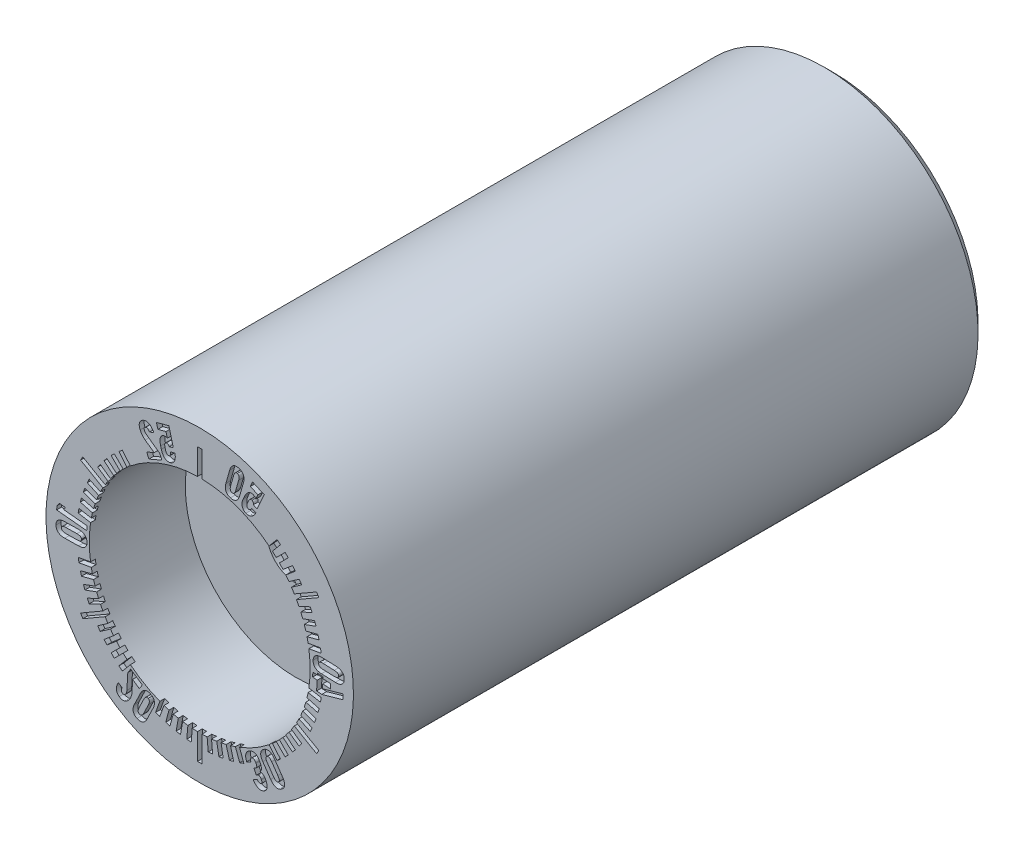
from build123d import *

# Parameters (mm, degrees)
SKETCH2_W          = 0.23
SKETCH2_H          = 1.36
CUT_EXTRUDE1_DEPTH = 0.25


with BuildPart() as part:
    # Sketch1 → Revolve1 (revolve)
    with BuildSketch(Plane(origin=(0, 0, 0), x_dir=(0, 0, -1), z_dir=(1, 0, 0))):
        Polygon((33, 4), (33, 7.5), (32.5, 8), (0, 8), (0, 5.75), (5, 5.75), (5, 1.5), (24, 1.5), (24, 4), align=None)
    revolve(axis=Axis((0, 0, 0), (0, 0, 1)))

    # Sketch2 → Cut-Extrude1 (cut)
    # profile 1 of 58: a face of its own
    with BuildSketch(Plane.XY):
        Polygon((-0.613964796, -5.69817271), (-0.384840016, -5.71821853), (-0.443234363, -6.385668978), (-0.672359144, -6.365623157), align=None)
    # profile 2 of 58: a face of its own
    with BuildSketch(Plane.XY):
        with Locations((0, 6.41)):
            Rectangle(SKETCH2_W, SKETCH2_H)
    # profile 3 of 58: a face of its own
    with BuildSketch(Plane.XY):
        Polygon((6.082620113, 3.644592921), (6.197620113, 3.445407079), (5.019825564, 2.765407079), (4.904825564, 2.964592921), align=None)
    # profile 4 of 58: a face of its own
    with BuildSketch(Plane.XY):
        Polygon((-1.10825695, -5.622978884), (-0.881751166, -5.662917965), (-0.998095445, -6.32273916), (-1.224601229, -6.282800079), align=None)
    # profile 5 of 58: a face of its own
    with BuildSketch(Plane.XY):
        Polygon((-1.594114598, -5.504990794), (-1.371951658, -5.564519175), (-1.545360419, -6.211689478), (-1.767523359, -6.152161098), align=None)
    # profile 6 of 58: a face of its own
    with BuildSketch(Plane.XY):
        Polygon((-2.067840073, -5.345106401), (-1.85171077, -5.423771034), (-2.080864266, -6.05336509), (-2.296993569, -5.974700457), align=None)
    # profile 7 of 58: a face of its own
    with BuildSketch(Plane.XY):
        with BuildLine():
            Line((2.445608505, -5.829393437), (2.661987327, -5.721853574))
            add(Edge.make_bspline(
                [(2.661987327, -5.721853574), (2.651809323, -5.6949133), (2.642890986, -5.654093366), (2.648126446, -5.601821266), (2.665063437, -5.559111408), (2.690776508, -5.53560956), (2.710836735, -5.526187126)],
                knots=[0, 0, 0, 0, 0.389245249, 0.552170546, 0.70216859, 1, 1, 1, 1], degree=3))
            add(Edge.make_bspline(
                [(2.710836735, -5.526187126), (2.728864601, -5.517712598), (2.758018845, -5.507920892), (2.797464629, -5.512052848), (2.825233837, -5.522007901), (2.851226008, -5.53879053), (2.885288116, -5.57128034), (2.904186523, -5.603274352), (2.91604825, -5.625892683)],
                knots=[0, 0, 0, 0, 0.23438613, 0.344211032, 0.455536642, 0.574540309, 0.701359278, 1, 1, 1, 1], degree=3))
            Line((2.91604825, -5.625892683), (2.932568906, -5.659008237))
            add(Edge.make_bspline(
                [(2.932568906, -5.659008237), (2.944143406, -5.683119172), (2.9597508, -5.71840926), (2.968323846, -5.765914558), (2.969560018, -5.796281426), (2.96456007, -5.823382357), (2.950229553, -5.854787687), (2.929749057, -5.871299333), (2.914837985, -5.878651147)],
                knots=[0, 0, 0, 0, 0.327056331, 0.463872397, 0.585664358, 0.694908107, 0.796361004, 1, 1, 1, 1], degree=3))
            Line((2.914837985, -5.878651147), (2.820849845, -5.925405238))
            Line((2.820849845, -5.925405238), (2.948993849, -6.182840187))
            Line((2.948993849, -6.182840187), (3.042981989, -6.136086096))
            add(Edge.make_bspline(
                [(3.042981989, -6.136086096), (3.055299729, -6.129691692), (3.076557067, -6.125570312), (3.104602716, -6.132367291), (3.124969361, -6.143937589), (3.145103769, -6.160485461), (3.17191165, -6.192052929), (3.189159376, -6.21995374), (3.19922707, -6.240709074)],
                knots=[0, 0, 0, 0, 0.198237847, 0.297495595, 0.408102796, 0.531347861, 0.669627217, 1, 1, 1, 1], degree=3))
            Line((3.19922707, -6.240709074), (3.211345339, -6.265238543))
            add(Edge.make_bspline(
                [(3.211345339, -6.265238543), (3.220742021, -6.284735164), (3.233033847, -6.313560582), (3.238904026, -6.352540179), (3.238458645, -6.377758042), (3.23317576, -6.400459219), (3.218801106, -6.426816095), (3.201090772, -6.441259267), (3.187546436, -6.447565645)],
                knots=[0, 0, 0, 0, 0.315551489, 0.448835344, 0.569436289, 0.679683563, 0.783667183, 1, 1, 1, 1], degree=3))
            add(Edge.make_bspline(
                [(3.187546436, -6.447565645), (3.17830772, -6.452309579), (3.163230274, -6.456400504), (3.142312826, -6.457289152), (3.126332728, -6.45457774), (3.109835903, -6.449990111), (3.093309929, -6.442496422), (3.07663056, -6.432701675), (3.060004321, -6.420364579), (3.043244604, -6.405708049), (3.020771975, -6.381735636), (3.00535098, -6.361508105), (2.995346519, -6.347214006)],
                knots=[0, 0, 0, 0, 0.131371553, 0.196429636, 0.264882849, 0.336661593, 0.413849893, 0.494996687, 0.582417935, 0.676904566, 0.777945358, 1, 1, 1, 1], degree=3))
            Line((2.995346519, -6.347214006), (2.779869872, -6.454629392))
            add(Edge.make_bspline(
                [(2.779869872, -6.454629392), (2.802870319, -6.493849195), (2.8409568, -6.548523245), (2.899315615, -6.612286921), (2.944542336, -6.651349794), (2.99103997, -6.683516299), (3.038500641, -6.708766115), (3.086877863, -6.726424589), (3.135747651, -6.736668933), (3.184406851, -6.739465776), (3.24892362, -6.733404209), (3.295367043, -6.717776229), (3.324393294, -6.703110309)],
                knots=[0, 0, 0, 0, 0.205722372, 0.300436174, 0.390487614, 0.475581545, 0.555836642, 0.633118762, 0.707861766, 0.781015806, 0.852868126, 1, 1, 1, 1], degree=3))
            add(Edge.make_bspline(
                [(3.324393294, -6.703110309), (3.347486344, -6.691305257), (3.380364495, -6.671723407), (3.418900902, -6.640099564), (3.443478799, -6.614796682), (3.464204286, -6.587259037), (3.48172627, -6.558029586), (3.495133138, -6.526513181), (3.505301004, -6.493407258), (3.511847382, -6.458686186), (3.514107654, -6.422550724), (3.51289223, -6.385157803), (3.507606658, -6.346493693), (3.498866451, -6.306570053), (3.481453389, -6.250209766), (3.463255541, -6.208519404), (3.449509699, -6.180664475)],
                knots=[0, 0, 0, 0, 0.127639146, 0.187303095, 0.244722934, 0.300675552, 0.356461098, 0.411895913, 0.468674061, 0.526509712, 0.585217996, 0.6463877, 0.710214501, 0.77685814, 0.847179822, 1, 1, 1, 1], degree=3))
            Line((3.449509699, -6.180664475), (3.428205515, -6.137866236))
            add(Edge.make_bspline(
                [(3.428205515, -6.137866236), (3.412790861, -6.107011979), (3.386075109, -6.063624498), (3.341111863, -6.014870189), (3.305001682, -5.985053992), (3.266318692, -5.96105214), (3.211499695, -5.93885842), (3.167883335, -5.931189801), (3.138627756, -5.931434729)],
                knots=[0, 0, 0, 0, 0.276131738, 0.404287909, 0.528874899, 0.64966238, 0.766898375, 1, 1, 1, 1], degree=3))
            add(Edge.make_bspline(
                [(3.138627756, -5.931434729), (3.161028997, -5.910964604), (3.187779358, -5.872339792), (3.206128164, -5.811908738), (3.210967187, -5.761217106), (3.207609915, -5.706648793), (3.190666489, -5.626172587), (3.167067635, -5.566451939), (3.146940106, -5.526922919)],
                knots=[0, 0, 0, 0, 0.208985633, 0.317146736, 0.433273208, 0.559005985, 0.693520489, 1, 1, 1, 1], degree=3))
            Line((3.146940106, -5.526922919), (3.125635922, -5.484124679))
            add(Edge.make_bspline(
                [(3.125635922, -5.484124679), (3.107031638, -5.445301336), (3.074164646, -5.392013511), (3.023461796, -5.329063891), (2.983440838, -5.291211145), (2.941720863, -5.25975852), (2.897393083, -5.236670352), (2.851702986, -5.219935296), (2.803995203, -5.211940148), (2.754990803, -5.210977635), (2.686497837, -5.220644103), (2.636805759, -5.239695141), (2.604523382, -5.255397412)],
                knots=[0, 0, 0, 0, 0.199662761, 0.289879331, 0.374672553, 0.454952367, 0.531756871, 0.606027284, 0.680061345, 0.75535563, 0.832918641, 1, 1, 1, 1], degree=3))
            add(Edge.make_bspline(
                [(2.604523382, -5.255397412), (2.572554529, -5.271444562), (2.527795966, -5.300551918), (2.478016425, -5.349917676), (2.447455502, -5.390972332), (2.422758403, -5.435810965), (2.404692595, -5.484260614), (2.393934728, -5.536245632), (2.389593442, -5.591110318), (2.392309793, -5.6485589), (2.406232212, -5.729967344), (2.428100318, -5.78979257), (2.445608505, -5.829393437)],
                knots=[0, 0, 0, 0, 0.161105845, 0.238201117, 0.314561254, 0.390768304, 0.467980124, 0.546459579, 0.6290429, 0.715177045, 0.804752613, 1, 1, 1, 1], degree=3))
        make_face()
    # profile 8 of 58: a face of its own
    with BuildSketch(Plane.XY):
        with BuildLine():
            Line((3.283704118, -5.405476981), (3.692754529, -5.997874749))
            add(Edge.make_bspline(
                [(3.692754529, -5.997874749), (3.71181555, -6.025645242), (3.741998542, -6.064578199), (3.786128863, -6.110800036), (3.819163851, -6.140308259), (3.853221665, -6.165517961), (3.887729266, -6.18714618), (3.923436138, -6.203894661), (3.959444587, -6.216969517), (3.996054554, -6.225702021), (4.032952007, -6.229534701), (4.06992987, -6.22894415), (4.107017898, -6.223758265), (4.144250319, -6.213916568), (4.195196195, -6.19373006), (4.231520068, -6.172420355), (4.255171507, -6.156354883)],
                knots=[0, 0, 0, 0, 0.152206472, 0.222057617, 0.288528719, 0.352081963, 0.413336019, 0.47221913, 0.529940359, 0.586185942, 0.641826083, 0.69712275, 0.752898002, 0.810629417, 0.87072242, 1, 1, 1, 1], degree=3))
            add(Edge.make_bspline(
                [(4.255171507, -6.156354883), (4.278586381, -6.139782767), (4.311806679, -6.113550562), (4.348494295, -6.072758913), (4.370819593, -6.041319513), (4.389092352, -6.008636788), (4.403217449, -5.974299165), (4.412472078, -5.938382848), (4.417538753, -5.901121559), (4.41801071, -5.862881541), (4.414851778, -5.82371284), (4.406790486, -5.78395945), (4.395282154, -5.743147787), (4.379063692, -5.701809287), (4.351517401, -5.643852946), (4.325136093, -5.60203146), (4.306210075, -5.574055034)],
                knots=[0, 0, 0, 0, 0.129652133, 0.189922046, 0.247023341, 0.303334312, 0.358574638, 0.414100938, 0.470267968, 0.52787655, 0.586376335, 0.647273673, 0.71063341, 0.777531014, 0.847418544, 1, 1, 1, 1], degree=3))
            Line((4.306210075, -5.574055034), (3.897159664, -4.981657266))
            add(Edge.make_bspline(
                [(3.897159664, -4.981657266), (3.878111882, -4.953871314), (3.847891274, -4.914982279), (3.803748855, -4.868621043), (3.770560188, -4.839295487), (3.736632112, -4.813924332), (3.702178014, -4.792393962), (3.666479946, -4.775637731), (3.630468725, -4.762553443), (3.593861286, -4.753864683), (3.556916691, -4.749864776), (3.519830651, -4.751073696), (3.48263391, -4.755773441), (3.445488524, -4.766038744), (3.394589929, -4.786037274), (3.35828827, -4.807448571), (3.334629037, -4.823478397)],
                knots=[0, 0, 0, 0, 0.152176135, 0.222013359, 0.288924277, 0.351998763, 0.413240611, 0.472111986, 0.52982171, 0.586056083, 0.641685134, 0.697151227, 0.753341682, 0.810667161, 0.870748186, 1, 1, 1, 1], degree=3))
            add(Edge.make_bspline(
                [(3.334629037, -4.823478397), (3.310798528, -4.839555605), (3.278089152, -4.866379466), (3.241221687, -4.907132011), (3.21887631, -4.938687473), (3.200895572, -4.971634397), (3.18706237, -5.006080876), (3.178096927, -5.042217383), (3.173322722, -5.079644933), (3.172697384, -5.11815497), (3.176154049, -5.157446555), (3.184154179, -5.197348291), (3.195656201, -5.238007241), (3.211694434, -5.279090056), (3.23905706, -5.336368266), (3.264760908, -5.37795411), (3.283704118, -5.405476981)],
                knots=[0, 0, 0, 0, 0.129871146, 0.190225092, 0.247875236, 0.30419583, 0.359502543, 0.415159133, 0.47198713, 0.529676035, 0.588904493, 0.649886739, 0.713334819, 0.779640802, 0.848939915, 1, 1, 1, 1], degree=3))
        make_face()
        with BuildLine():
            Line((3.747047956, -5.177970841), (4.069477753, -5.645118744))
            add(Edge.make_bspline(
                [(4.069477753, -5.645118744), (4.088955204, -5.673009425), (4.113808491, -5.714479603), (4.135726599, -5.77101696), (4.143867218, -5.807754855), (4.14390305, -5.841700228), (4.132578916, -5.88351946), (4.109357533, -5.907613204), (4.091890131, -5.919592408)],
                knots=[0, 0, 0, 0, 0.330237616, 0.465954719, 0.586663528, 0.693024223, 0.792259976, 1, 1, 1, 1], degree=3))
            add(Edge.make_bspline(
                [(4.091890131, -5.919592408), (4.074373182, -5.931550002), (4.043716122, -5.944884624), (4.000599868, -5.940838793), (3.969049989, -5.928763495), (3.937464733, -5.908318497), (3.892187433, -5.867870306), (3.862171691, -5.82981349), (3.842752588, -5.801862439)],
                knots=[0, 0, 0, 0, 0.208249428, 0.306743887, 0.4129016, 0.532913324, 0.669579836, 1, 1, 1, 1], degree=3))
            Line((3.842752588, -5.801862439), (3.52032279, -5.334714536))
            add(Edge.make_bspline(
                [(3.52032279, -5.334714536), (3.501088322, -5.306604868), (3.475498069, -5.265345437), (3.453871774, -5.208524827), (3.446148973, -5.171720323), (3.445876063, -5.137916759), (3.457858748, -5.09640456), (3.480606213, -5.072297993), (3.498211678, -5.060354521)],
                knots=[0, 0, 0, 0, 0.33104826, 0.467565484, 0.587735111, 0.694108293, 0.792235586, 1, 1, 1, 1], degree=3))
            add(Edge.make_bspline(
                [(3.498211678, -5.060354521), (3.515700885, -5.048500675), (3.546270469, -5.035048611), (3.589495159, -5.038710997), (3.621079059, -5.05083701), (3.652511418, -5.071302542), (3.697819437, -5.111644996), (3.727564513, -5.150026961), (3.747047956, -5.177970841)],
                knots=[0, 0, 0, 0, 0.207401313, 0.307193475, 0.413360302, 0.532362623, 0.669040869, 1, 1, 1, 1], degree=3))
        make_face(mode=Mode.SUBTRACT)
    # profile 9 of 58: a face of its own
    with BuildSketch(Plane.XY):
        Polygon((-3.771268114, -4.315514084), (-3.595077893, -4.463355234), (-4.025745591, -4.976605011), (-4.201935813, -4.828763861), align=None)
    # profile 10 of 58: a face of its own
    with BuildSketch(Plane.XY):
        Polygon((-4.133039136, -3.970404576), (-3.970404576, -4.133039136), (-4.44416612, -4.606800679), (-4.606800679, -4.44416612), align=None)
    # profile 11 of 58: a face of its own
    with BuildSketch(Plane.XY):
        Polygon((-4.463355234, -3.595077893), (-4.315514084, -3.771268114), (-4.828763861, -4.201935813), (-4.976605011, -4.025745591), align=None)
    # profile 12 of 58: a face of its own
    with BuildSketch(Plane.XY):
        Polygon((-4.759702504, -3.192390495), (-4.627779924, -3.380795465), (-5.176611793, -3.765091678), (-5.308534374, -3.576686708), align=None)
    # profile 13 of 58: a face of its own
    with BuildSketch(Plane.XY):
        Polygon((6.197620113, -3.445407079), (6.082620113, -3.644592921), (4.904825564, -2.964592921), (5.019825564, -2.765407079), align=None)
    # profile 14 of 58: a face of its own
    with BuildSketch(Plane.XY):
        Polygon((-5.24174472, -2.317377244), (-5.14454252, -2.525828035), (-5.751768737, -2.808982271), (-5.848970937, -2.60053148), align=None)
    # profile 15 of 58: a face of its own
    with BuildSketch(Plane.XY):
        Polygon((-5.423771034, -1.85171077), (-5.345106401, -2.067840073), (-5.974700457, -2.296993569), (-6.05336509, -2.080864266), align=None)
    # profile 16 of 58: a face of its own
    with BuildSketch(Plane.XY):
        Polygon((-5.564519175, -1.371951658), (-5.504990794, -1.594114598), (-6.152161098, -1.767523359), (-6.211689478, -1.545360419), align=None)
    # profile 17 of 58: a face of its own
    with BuildSketch(Plane.XY):
        Polygon((-5.662917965, -0.881751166), (-5.622978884, -1.10825695), (-6.282800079, -1.224601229), (-6.32273916, -0.998095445), align=None)
    # profile 18 of 58: a face of its own
    with BuildSketch(Plane.XY):
        Polygon((6.354142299, -0.838181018), (7.443637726, -0.529072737), (7.462165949, -0.263788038), (6.386655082, -0.563455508), (6.402319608, -0.337012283), (6.802276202, -0.364854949), (6.818478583, -0.130454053), (6.418534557, -0.102612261), (6.42527681, -0.005147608), (6.138401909, 0.014744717), (6.131637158, -0.082640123), (5.888343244, -0.065703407), (5.872140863, -0.300104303), (6.115355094, -0.317035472), (6.080476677, -0.819142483), align=None)
    # profile 19 of 58: a face of its own
    with BuildSketch(Plane.XY):
        Polygon((-5.622978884, 1.10825695), (-5.662917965, 0.881751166), (-6.32273916, 0.998095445), (-6.282800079, 1.224601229), align=None)
    # profile 20 of 58: a face of its own
    with BuildSketch(Plane.XY):
        Polygon((-5.504990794, 1.594114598), (-5.564519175, 1.371951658), (-6.211689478, 1.545360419), (-6.152161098, 1.767523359), align=None)
    # profile 21 of 58: a face of its own
    with BuildSketch(Plane.XY):
        Polygon((-5.345106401, 2.067840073), (-5.423771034, 1.85171077), (-6.05336509, 2.080864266), (-5.974700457, 2.296993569), align=None)
    # profile 22 of 58: a face of its own
    with BuildSketch(Plane.XY):
        Polygon((-5.14454252, 2.525828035), (-5.24174472, 2.317377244), (-5.848970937, 2.60053148), (-5.751768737, 2.808982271), align=None)
    # profile 23 of 58: a face of its own
    with BuildSketch(Plane.XY):
        with Locations((0, -6.41)):
            Rectangle(SKETCH2_W, SKETCH2_H)
    # profile 24 of 58: a face of its own
    with BuildSketch(Plane.XY):
        Polygon((-4.627779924, 3.380795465), (-4.759702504, 3.192390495), (-5.308534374, 3.576686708), (-5.176611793, 3.765091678), align=None)
    # profile 25 of 58: a face of its own
    with BuildSketch(Plane.XY):
        Polygon((-4.315514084, 3.771268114), (-4.463355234, 3.595077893), (-4.976605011, 4.025745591), (-4.828763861, 4.201935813), align=None)
    # profile 26 of 58: a face of its own
    with BuildSketch(Plane.XY):
        Polygon((-3.970404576, 4.133039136), (-4.133039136, 3.970404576), (-4.606800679, 4.44416612), (-4.44416612, 4.606800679), align=None)
    # profile 27 of 58: a face of its own
    with BuildSketch(Plane.XY):
        Polygon((-3.595077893, 4.463355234), (-3.771268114, 4.315514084), (-4.201935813, 4.828763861), (-4.025745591, 4.976605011), align=None)
    # profile 28 of 58: a face of its own
    with BuildSketch(Plane.XY):
        with BuildLine():
            Line((6.337183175, 0.084459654), (7.056690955, 0.057232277))
            add(Edge.make_bspline(
                [(7.056690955, 0.057232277), (7.09032117, 0.056193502), (7.139675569, 0.056642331), (7.203180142, 0.064587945), (7.246727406, 0.073100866), (7.287373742, 0.084971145), (7.325196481, 0.100176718), (7.360184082, 0.118385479), (7.392146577, 0.139701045), (7.420795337, 0.16404027), (7.446204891, 0.191087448), (7.467517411, 0.221327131), (7.485945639, 0.253952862), (7.499888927, 0.289901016), (7.514221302, 0.342728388), (7.51961562, 0.384445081), (7.520294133, 0.413051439)],
                knots=[0, 0, 0, 0, 0.152073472, 0.22227343, 0.28881624, 0.352284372, 0.413223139, 0.472650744, 0.530126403, 0.586359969, 0.642108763, 0.697247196, 0.753071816, 0.810938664, 0.870870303, 1, 1, 1, 1], degree=3))
            add(Edge.make_bspline(
                [(7.520294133, 0.413051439), (7.521659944, 0.441768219), (7.519390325, 0.483885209), (7.50967676, 0.537977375), (7.497713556, 0.574701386), (7.482721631, 0.609021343), (7.463285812, 0.640477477), (7.440512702, 0.669654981), (7.413613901, 0.695759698), (7.383388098, 0.719215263), (7.349944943, 0.739811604), (7.313511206, 0.757765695), (7.273695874, 0.772073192), (7.231162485, 0.78457555), (7.168074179, 0.796745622), (7.118822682, 0.801010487), (7.085038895, 0.802525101)],
                knots=[0, 0, 0, 0, 0.129600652, 0.189845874, 0.24755901, 0.303577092, 0.358530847, 0.414043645, 0.47027301, 0.527288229, 0.586455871, 0.647313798, 0.710308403, 0.77722874, 0.847291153, 1, 1, 1, 1], degree=3))
            Line((7.085038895, 0.802525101), (6.365531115, 0.829752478))
            add(Edge.make_bspline(
                [(6.365531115, 0.829752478), (6.331890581, 0.830762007), (6.282568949, 0.830242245), (6.219078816, 0.822563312), (6.175646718, 0.813335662), (6.134976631, 0.801717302), (6.097087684, 0.786909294), (6.062230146, 0.768710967), (6.030136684, 0.747712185), (6.001467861, 0.72325169), (5.976057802, 0.696215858), (5.954648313, 0.665916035), (5.936398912, 0.633189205), (5.922417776, 0.597274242), (5.907299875, 0.544731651), (5.903203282, 0.502756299), (5.901641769, 0.474287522)],
                knots=[0, 0, 0, 0, 0.152127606, 0.222354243, 0.288607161, 0.352547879, 0.413283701, 0.472061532, 0.529932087, 0.586187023, 0.641957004, 0.697116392, 0.753408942, 0.810830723, 0.870865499, 1, 1, 1, 1], degree=3))
            add(Edge.make_bspline(
                [(5.901641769, 0.474287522), (5.900727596, 0.445551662), (5.90175626, 0.403126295), (5.913179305, 0.349317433), (5.924719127, 0.312458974), (5.940334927, 0.278185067), (5.959680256, 0.246436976), (5.983162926, 0.217500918), (6.010370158, 0.191296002), (6.040797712, 0.167622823), (6.074634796, 0.147288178), (6.111041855, 0.129397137), (6.150555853, 0.11450041), (6.193104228, 0.102765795), (6.255220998, 0.089729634), (6.303981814, 0.086121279), (6.337183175, 0.084459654)],
                knots=[0, 0, 0, 0, 0.130182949, 0.19030412, 0.248064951, 0.304374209, 0.360053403, 0.415607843, 0.472264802, 0.530407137, 0.589414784, 0.650323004, 0.713490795, 0.779905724, 0.849588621, 1, 1, 1, 1], degree=3))
        make_face()
        with BuildLine():
            Line((6.432883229, 0.592050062), (6.999854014, 0.570667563))
            add(Edge.make_bspline(
                [(6.999854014, 0.570667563), (7.033999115, 0.569581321), (7.082113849, 0.564336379), (7.140569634, 0.548051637), (7.174797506, 0.532414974), (7.202001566, 0.512159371), (7.228107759, 0.477670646), (7.233989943, 0.445091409), (7.232932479, 0.423830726)],
                knots=[0, 0, 0, 0, 0.331429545, 0.466797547, 0.586951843, 0.694421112, 0.792381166, 1, 1, 1, 1], degree=3))
            add(Edge.make_bspline(
                [(7.232932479, 0.423830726), (7.232799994, 0.402422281), (7.22432524, 0.370414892), (7.195760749, 0.337877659), (7.166996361, 0.320062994), (7.131807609, 0.306579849), (7.072220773, 0.294527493), (7.023699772, 0.293821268), (6.989659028, 0.294900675)],
                knots=[0, 0, 0, 0, 0.20793446, 0.305765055, 0.41298862, 0.532559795, 0.66940328, 1, 1, 1, 1], degree=3))
            Line((6.989659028, 0.294900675), (6.422688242, 0.316283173))
            add(Edge.make_bspline(
                [(6.422688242, 0.316283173), (6.388645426, 0.317882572), (6.340187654, 0.321942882), (6.281763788, 0.338947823), (6.247563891, 0.354628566), (6.219944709, 0.374473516), (6.194447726, 0.409499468), (6.18750246, 0.441673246), (6.188969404, 0.463188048)],
                knots=[0, 0, 0, 0, 0.330757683, 0.467087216, 0.587021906, 0.693755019, 0.792300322, 1, 1, 1, 1], degree=3))
            add(Edge.make_bspline(
                [(6.188969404, 0.463188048), (6.189312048, 0.484542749), (6.198104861, 0.516295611), (6.226346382, 0.549074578), (6.25523324, 0.567055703), (6.290714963, 0.579889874), (6.350267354, 0.592124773), (6.398818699, 0.593409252), (6.432883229, 0.592050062)],
                knots=[0, 0, 0, 0, 0.206874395, 0.305502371, 0.412664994, 0.532619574, 0.669385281, 1, 1, 1, 1], degree=3))
        make_face(mode=Mode.SUBTRACT)
    # profile 29 of 58: a face of its own
    with BuildSketch(Plane.XY):
        Polygon((-6.082620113, -3.644592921), (-6.197620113, -3.445407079), (-5.019825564, -2.765407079), (-4.904825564, -2.964592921), align=None)
    # profile 30 of 58: a face of its own
    with BuildSketch(Plane.XY):
        Polygon((-6.197620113, 3.445407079), (-6.082620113, 3.644592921), (-4.904825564, 2.964592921), (-5.019825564, 2.765407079), align=None)
    # profile 31 of 58: a face of its own
    with BuildSketch(Plane.XY):
        Polygon((3.771268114, 4.315514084), (3.595077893, 4.463355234), (4.025745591, 4.976605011), (4.201935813, 4.828763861), align=None)
    # profile 32 of 58: a face of its own
    with BuildSketch(Plane.XY):
        Polygon((4.133039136, 3.970404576), (3.970404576, 4.133039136), (4.44416612, 4.606800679), (4.606800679, 4.44416612), align=None)
    # profile 33 of 58: a face of its own
    with BuildSketch(Plane.XY):
        Polygon((4.463355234, 3.595077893), (4.315514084, 3.771268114), (4.828763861, 4.201935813), (4.976605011, 4.025745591), align=None)
    # profile 34 of 58: a face of its own
    with BuildSketch(Plane.XY):
        Polygon((4.759702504, 3.192390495), (4.627779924, 3.380795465), (5.176611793, 3.765091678), (5.308534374, 3.576686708), align=None)
    # profile 35 of 58: a face of its own
    with BuildSketch(Plane.XY):
        Polygon((5.24174472, 2.317377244), (5.14454252, 2.525828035), (5.751768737, 2.808982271), (5.848970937, 2.60053148), align=None)
    # profile 36 of 58: a face of its own
    with BuildSketch(Plane.XY):
        Polygon((5.423771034, 1.85171077), (5.345106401, 2.067840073), (5.974700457, 2.296993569), (6.05336509, 2.080864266), align=None)
    # profile 37 of 58: a face of its own
    with BuildSketch(Plane.XY):
        Polygon((5.564519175, 1.371951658), (5.504990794, 1.594114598), (6.152161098, 1.767523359), (6.211689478, 1.545360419), align=None)
    # profile 38 of 58: a face of its own
    with BuildSketch(Plane.XY):
        Polygon((5.662917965, 0.881751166), (5.622978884, 1.10825695), (6.282800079, 1.224601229), (6.32273916, 0.998095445), align=None)
    # profile 39 of 58: a face of its own
    with BuildSketch(Plane.XY):
        Polygon((5.622978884, -1.10825695), (5.662917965, -0.881751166), (6.32273916, -0.998095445), (6.282800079, -1.224601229), align=None)
    # profile 40 of 58: a face of its own
    with BuildSketch(Plane.XY):
        Polygon((5.504990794, -1.594114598), (5.564519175, -1.371951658), (6.211689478, -1.545360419), (6.152161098, -1.767523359), align=None)
    # profile 41 of 58: a face of its own
    with BuildSketch(Plane.XY):
        Polygon((5.345106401, -2.067840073), (5.423771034, -1.85171077), (6.05336509, -2.080864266), (5.974700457, -2.296993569), align=None)
    # profile 42 of 58: a face of its own
    with BuildSketch(Plane.XY):
        Polygon((5.14454252, -2.525828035), (5.24174472, -2.317377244), (5.848970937, -2.60053148), (5.751768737, -2.808982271), align=None)
    # profile 43 of 58: a face of its own
    with BuildSketch(Plane.XY):
        Polygon((4.627779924, -3.380795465), (4.759702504, -3.192390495), (5.308534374, -3.576686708), (5.176611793, -3.765091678), align=None)
    # profile 44 of 58: a face of its own
    with BuildSketch(Plane.XY):
        Polygon((4.315514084, -3.771268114), (4.463355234, -3.595077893), (4.976605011, -4.025745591), (4.828763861, -4.201935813), align=None)
    # profile 45 of 58: a face of its own
    with BuildSketch(Plane.XY):
        Polygon((3.970404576, -4.133039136), (4.133039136, -3.970404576), (4.606800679, -4.44416612), (4.44416612, -4.606800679), align=None)
    # profile 46 of 58: a face of its own
    with BuildSketch(Plane.XY):
        Polygon((3.595077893, -4.463355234), (3.771268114, -4.315514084), (4.201935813, -4.828763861), (4.025745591, -4.976605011), align=None)
    # profile 47 of 58: a face of its own
    with BuildSketch(Plane.XY):
        Polygon((1.85171077, -5.423771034), (2.067840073, -5.345106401), (2.296993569, -5.974700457), (2.080864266, -6.05336509), align=None)
    # profile 48 of 58: a face of its own
    with BuildSketch(Plane.XY):
        Polygon((1.371951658, -5.564519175), (1.594114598, -5.504990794), (1.767523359, -6.152161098), (1.545360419, -6.211689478), align=None)
    # profile 49 of 58: a face of its own
    with BuildSketch(Plane.XY):
        Polygon((0.881751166, -5.662917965), (1.10825695, -5.622978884), (1.224601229, -6.282800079), (0.998095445, -6.32273916), align=None)
    # profile 50 of 58: a face of its own
    with BuildSketch(Plane.XY):
        Polygon((0.384840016, -5.71821853), (0.613964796, -5.69817271), (0.672359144, -6.365623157), (0.443234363, -6.385668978), align=None)
    # profile 51 of 58: a face of its own
    with BuildSketch(Plane.XY):
        with BuildLine():
            add(Edge.make_bspline(
                [(2.402952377, 5.34994367), (2.417967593, 5.343830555), (2.447563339, 5.331781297), (2.494497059, 5.322568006), (2.541834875, 5.320723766), (2.589515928, 5.326148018), (2.636947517, 5.339438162), (2.683643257, 5.35977653), (2.729131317, 5.38787146), (2.773244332, 5.422967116), (2.815681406, 5.465100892), (2.855461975, 5.514136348), (2.892624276, 5.569640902), (2.914263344, 5.609919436), (2.925400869, 5.630650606)],
                knots=[0, 0, 0, 0, 0.884436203, 1.743268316, 2.597943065, 3.465407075, 4.354790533, 5.280501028, 6.240180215, 7.268463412, 8.35531956, 9.502034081, 10.714308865, 12, 12, 12, 12], degree=3))
            Line((2.925400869, 5.630650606), (2.925909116, 5.631532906))
            Line((2.925909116, 5.631532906), (2.713723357, 5.726852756))
            Line((2.713723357, 5.726852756), (2.71321511, 5.725970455))
            add(Edge.make_bspline(
                [(2.71321511, 5.725970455), (2.706296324, 5.714158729), (2.693129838, 5.691680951), (2.67070775, 5.661820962), (2.646550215, 5.638022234), (2.62137956, 5.619945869), (2.59525443, 5.608470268), (2.568964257, 5.602843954), (2.542307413, 5.604639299), (2.525765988, 5.6107771), (2.517295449, 5.613920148)],
                knots=[0, 0, 0, 0, 1.316783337, 2.505845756, 3.581275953, 4.569062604, 5.470567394, 6.308469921, 7.133800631, 8, 8, 8, 8], degree=3))
            add(Edge.make_bspline(
                [(2.517295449, 5.613920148), (2.508712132, 5.618479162), (2.492115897, 5.627294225), (2.472297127, 5.647258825), (2.458472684, 5.671435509), (2.450800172, 5.699799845), (2.449466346, 5.73174676), (2.453408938, 5.766861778), (2.464161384, 5.804764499), (2.474665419, 5.830234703), (2.480230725, 5.843729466)],
                knots=[0, 0, 0, 0, 0.88925093, 1.719407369, 2.545568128, 3.423584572, 4.392701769, 5.468432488, 6.658710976, 8, 8, 8, 8], degree=3))
            Line((2.480230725, 5.843729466), (2.534324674, 5.964153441))
            add(Edge.make_bspline(
                [(2.534324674, 5.964153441), (2.540587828, 5.977300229), (2.552467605, 6.002236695), (2.573555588, 6.035144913), (2.595434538, 6.062304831), (2.619022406, 6.082607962), (2.643430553, 6.096538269), (2.668539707, 6.103288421), (2.694176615, 6.103056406), (2.709966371, 6.096936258), (2.718054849, 6.093801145)],
                knots=[0, 0, 0, 0, 1.391179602, 2.638751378, 3.728763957, 4.714188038, 5.598024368, 6.392034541, 7.176301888, 8, 8, 8, 8], degree=3))
            add(Edge.make_bspline(
                [(2.718054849, 6.093801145), (2.725297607, 6.090163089), (2.739453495, 6.083052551), (2.757463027, 6.067812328), (2.772647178, 6.05013235), (2.783588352, 6.029095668), (2.791129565, 6.005986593), (2.794940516, 5.980965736), (2.79466106, 5.954124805), (2.791633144, 5.935947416), (2.790055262, 5.926474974)],
                knots=[0, 0, 0, 0, 0.978692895, 1.91284404, 2.836347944, 3.785578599, 4.763839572, 5.770041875, 6.837943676, 8, 8, 8, 8], degree=3))
            Line((2.790055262, 5.926474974), (2.988471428, 5.837441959))
            Line((2.988471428, 5.837441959), (3.358728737, 6.661747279))
            Line((3.358728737, 6.661747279), (2.753480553, 6.933314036))
            Line((2.753480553, 6.933314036), (2.636384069, 6.672921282))
            Line((2.636384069, 6.672921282), (3.029446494, 6.496674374))
            Line((3.029446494, 6.496674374), (2.915720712, 6.243152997))
            add(Edge.make_bspline(
                [(2.915720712, 6.243152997), (2.913649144, 6.249830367), (2.90943633, 6.263409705), (2.899213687, 6.282614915), (2.886968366, 6.301714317), (2.871219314, 6.319234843), (2.854383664, 6.33613721), (2.836083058, 6.350930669), (2.816715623, 6.363405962), (2.803159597, 6.37019487), (2.796382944, 6.373588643)],
                knots=[0, 0, 0, 0, 0.919939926, 1.8708225, 2.857576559, 3.904988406, 4.968813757, 6.001880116, 7.001140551, 8, 8, 8, 8], degree=3))
            add(Edge.make_bspline(
                [(2.796382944, 6.373588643), (2.781953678, 6.379366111), (2.753865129, 6.390612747), (2.709718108, 6.398711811), (2.665994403, 6.398783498), (2.622675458, 6.390817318), (2.580252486, 6.375060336), (2.538842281, 6.351480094), (2.49842646, 6.320667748), (2.459746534, 6.281775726), (2.422272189, 6.236207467), (2.386250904, 6.183880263), (2.352726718, 6.12429674), (2.332594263, 6.081630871), (2.322138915, 6.05947329)],
                knots=[0, 0, 0, 0, 0.875578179, 1.704433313, 2.515407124, 3.330983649, 4.176952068, 5.05744134, 6.011313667, 7.036558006, 8.146089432, 9.337674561, 10.61737983, 12, 12, 12, 12], degree=3))
            Line((2.322138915, 6.05947329), (2.268044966, 5.939049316))
            add(Edge.make_bspline(
                [(2.268044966, 5.939049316), (2.258407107, 5.916481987), (2.239822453, 5.872965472), (2.219164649, 5.807380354), (2.205727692, 5.744704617), (2.199127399, 5.685044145), (2.200017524, 5.628713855), (2.207974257, 5.575898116), (2.223209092, 5.526836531), (2.245336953, 5.48171299), (2.274486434, 5.440918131), (2.310932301, 5.405307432), (2.353758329, 5.37392082), (2.386222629, 5.35809774), (2.402952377, 5.34994367)],
                knots=[0, 0, 0, 0, 1.292650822, 2.49261485, 3.617137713, 4.666146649, 5.649005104, 6.577839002, 7.471491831, 8.345616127, 9.215760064, 10.099964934, 11.020859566, 12, 12, 12, 12], degree=3))
        make_face()
    # profile 52 of 58: a face of its own
    with BuildSketch(Plane.XY):
        with BuildLine():
            add(Edge.make_bspline(
                [(1.598481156, 5.641619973), (1.612810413, 5.637877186), (1.640636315, 5.630609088), (1.682479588, 5.624891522), (1.72253071, 5.622980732), (1.761158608, 5.625695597), (1.798063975, 5.632771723), (1.833349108, 5.644281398), (1.867112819, 5.659803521), (1.899010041, 5.679864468), (1.929007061, 5.704083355), (1.957087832, 5.731751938), (1.98273586, 5.763376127), (2.006847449, 5.797965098), (2.028547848, 5.836489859), (2.047708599, 5.878568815), (2.065676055, 5.923945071), (2.075229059, 5.9558624), (2.080150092, 5.972303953)],
                knots=[0, 0, 0, 0, 1.070285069, 2.078380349, 3.047993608, 3.965724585, 4.872224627, 5.758830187, 6.643700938, 7.553253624, 8.476450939, 9.4272374, 10.398806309, 11.417160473, 12.473590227, 13.591461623, 14.7592912, 16, 16, 16, 16], degree=3))
            Line((2.080150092, 5.972303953), (2.276221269, 6.663850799))
            add(Edge.make_bspline(
                [(2.276221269, 6.663850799), (2.280748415, 6.680568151), (2.289549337, 6.713067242), (2.298341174, 6.761400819), (2.303718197, 6.807675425), (2.305533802, 6.851882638), (2.303159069, 6.894123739), (2.297902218, 6.934355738), (2.288319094, 6.972496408), (2.275137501, 7.008451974), (2.258299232, 7.042016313), (2.237764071, 7.072982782), (2.213644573, 7.101072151), (2.186086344, 7.12655119), (2.154705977, 7.148843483), (2.119450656, 7.167839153), (2.081162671, 7.185017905), (2.053706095, 7.193338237), (2.039641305, 7.197600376)],
                knots=[0, 0, 0, 0, 1.252449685, 2.43480403, 3.549769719, 4.620691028, 5.6308064, 6.607051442, 7.551437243, 8.469408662, 9.372282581, 10.261634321, 11.150511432, 12.044359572, 12.970406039, 13.926560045, 14.93786835, 16, 16, 16, 16], degree=3))
            add(Edge.make_bspline(
                [(2.039641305, 7.197600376), (2.025307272, 7.201302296), (1.997513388, 7.20848037), (1.95577942, 7.21475953), (1.915746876, 7.216302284), (1.877181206, 7.214464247), (1.840482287, 7.20703544), (1.805114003, 7.196368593), (1.771513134, 7.180666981), (1.739721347, 7.16081509), (1.709515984, 7.137252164), (1.681703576, 7.109538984), (1.655642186, 7.078511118), (1.632082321, 7.043511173), (1.61019068, 7.005006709), (1.590770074, 6.962541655), (1.572869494, 6.916525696), (1.563259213, 6.884141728), (1.558310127, 6.867464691)],
                knots=[0, 0, 0, 0, 1.069624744, 2.074016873, 3.043031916, 3.962032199, 4.857011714, 5.742254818, 6.626579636, 7.528625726, 8.446610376, 9.389274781, 10.361328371, 11.370920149, 12.434450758, 13.559336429, 14.743111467, 16, 16, 16, 16], degree=3))
            Line((1.558310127, 6.867464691), (1.36223895, 6.175917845))
            add(Edge.make_bspline(
                [(1.36223895, 6.175917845), (1.357713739, 6.159200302), (1.348916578, 6.126700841), (1.340098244, 6.078369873), (1.334819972, 6.032138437), (1.332674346, 5.987927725), (1.33464377, 5.945614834), (1.340702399, 5.905413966), (1.350206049, 5.86723485), (1.363052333, 5.83107352), (1.380011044, 5.797486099), (1.400521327, 5.766507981), (1.424651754, 5.738429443), (1.452190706, 5.712918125), (1.483636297, 5.690752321), (1.518615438, 5.671270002), (1.556976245, 5.654232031), (1.584421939, 5.645892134), (1.598481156, 5.641619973)],
                knots=[0, 0, 0, 0, 1.251974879, 2.433880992, 3.548423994, 4.615134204, 5.631259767, 6.606146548, 7.550174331, 8.472610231, 9.375141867, 10.264156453, 11.152696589, 12.04620587, 12.971901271, 13.92734609, 14.938271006, 16, 16, 16, 16], degree=3))
        make_face()
        with BuildLine():
            add(Edge.make_bspline(
                [(1.676761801, 5.917875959), (1.666186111, 5.921668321), (1.645918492, 5.928936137), (1.620287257, 5.948495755), (1.602386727, 5.974802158), (1.591654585, 6.006919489), (1.587328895, 6.04425004), (1.588641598, 6.086832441), (1.595843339, 6.134520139), (1.604499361, 6.167486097), (1.609087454, 6.184959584)],
                knots=[0, 0, 0, 0, 0.868160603, 1.663773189, 2.454488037, 3.30129119, 4.266468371, 5.356403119, 6.598771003, 8, 8, 8, 8], degree=3))
            Line((1.609087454, 6.184959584), (1.763683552, 6.729984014))
            add(Edge.make_bspline(
                [(1.763683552, 6.729984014), (1.768942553, 6.747331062), (1.778862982, 6.780054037), (1.797611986, 6.824506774), (1.818772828, 6.861355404), (1.842102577, 6.890672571), (1.867957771, 6.91264775), (1.897428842, 6.924976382), (1.929416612, 6.928650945), (1.950452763, 6.923839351), (1.96136066, 6.92134439)],
                knots=[0, 0, 0, 0, 1.40571135, 2.651693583, 3.734530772, 4.692025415, 5.5479568, 6.335932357, 7.13712939, 8, 8, 8, 8], degree=3))
            add(Edge.make_bspline(
                [(1.96136066, 6.92134439), (1.972002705, 6.917671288), (1.992382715, 6.910637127), (2.01801607, 6.890987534), (2.035879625, 6.864601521), (2.046948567, 6.832662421), (2.05109239, 6.795357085), (2.049825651, 6.752940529), (2.042618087, 6.705141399), (2.033858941, 6.672096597), (2.029203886, 6.654534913)],
                knots=[0, 0, 0, 0, 0.869041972, 1.66425555, 2.454573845, 3.307436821, 4.260421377, 5.349809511, 6.591554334, 8, 8, 8, 8], degree=3))
            Line((2.029203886, 6.654534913), (1.874607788, 6.109510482))
            add(Edge.make_bspline(
                [(1.874607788, 6.109510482), (1.869397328, 6.092140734), (1.85960346, 6.059491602), (1.840277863, 6.01532338), (1.819684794, 5.978172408), (1.796166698, 5.948832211), (1.770339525, 5.926849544), (1.740858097, 5.914499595), (1.708845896, 5.910914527), (1.687730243, 5.915496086), (1.676761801, 5.917875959)],
                knots=[0, 0, 0, 0, 1.405311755, 2.641501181, 3.732575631, 4.689798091, 5.545486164, 6.333237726, 7.134207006, 8, 8, 8, 8], degree=3))
        make_face(mode=Mode.SUBTRACT)
    # profile 53 of 58: a face of its own
    with BuildSketch(Plane.XY):
        with BuildLine():
            add(Edge.make_bspline(
                [(-1.519904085, 5.664564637), (-1.504287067, 5.669336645), (-1.473537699, 5.678732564), (-1.431293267, 5.701812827), (-1.392920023, 5.730047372), (-1.359206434, 5.764654), (-1.330513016, 5.804795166), (-1.307231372, 5.850255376), (-1.289716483, 5.9007853), (-1.277218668, 5.95591527), (-1.271305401, 6.015507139), (-1.270880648, 6.078740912), (-1.276960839, 6.145517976), (-1.285545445, 6.190628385), (-1.289971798, 6.213888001)],
                knots=[0, 0, 0, 0, 0.887279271, 1.747022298, 2.606188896, 3.474138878, 4.366180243, 5.283878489, 6.245660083, 7.27152389, 8.355349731, 9.500205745, 10.71106785, 12, 12, 12, 12], degree=3))
            Line((-1.289971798, 6.213888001), (-1.290175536, 6.214885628))
            Line((-1.290175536, 6.214885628), (-1.516219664, 6.15438103))
            Line((-1.516219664, 6.15438103), (-1.516015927, 6.153383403))
            add(Edge.make_bspline(
                [(-1.516015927, 6.153383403), (-1.513974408, 6.139817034), (-1.510081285, 6.113946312), (-1.508712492, 6.076490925), (-1.512449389, 6.042692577), (-1.520358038, 6.012655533), (-1.533137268, 5.987015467), (-1.550646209, 5.966531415), (-1.572112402, 5.950624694), (-1.589001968, 5.945167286), (-1.597632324, 5.942378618)],
                knots=[0, 0, 0, 0, 1.31587536, 2.509341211, 3.584571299, 4.567719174, 5.476120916, 6.306758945, 7.134775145, 8, 8, 8, 8], degree=3))
            add(Edge.make_bspline(
                [(-1.597632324, 5.942378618), (-1.607256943, 5.940375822), (-1.625814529, 5.936514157), (-1.654010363, 5.939252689), (-1.680107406, 5.949333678), (-1.704102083, 5.966395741), (-1.725734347, 5.990098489), (-1.744550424, 6.020170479), (-1.76074585, 6.056318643), (-1.768591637, 6.082978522), (-1.772749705, 6.097107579)],
                knots=[0, 0, 0, 0, 0.894537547, 1.724791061, 2.547591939, 3.425348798, 4.391576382, 5.462051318, 6.65495184, 8, 8, 8, 8], degree=3))
            Line((-1.772749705, 6.097107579), (-1.806894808, 6.2246114))
            add(Edge.make_bspline(
                [(-1.806894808, 6.2246114), (-1.810331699, 6.23883779), (-1.816840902, 6.265781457), (-1.821840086, 6.304860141), (-1.82111437, 6.339890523), (-1.815893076, 6.370688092), (-1.805649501, 6.396871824), (-1.790315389, 6.417956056), (-1.770029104, 6.433714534), (-1.75395774, 6.439219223), (-1.745712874, 6.442043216)],
                knots=[0, 0, 0, 0, 1.393181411, 2.638576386, 3.739360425, 4.718239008, 5.599399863, 6.391210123, 7.174665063, 8, 8, 8, 8], degree=3))
            add(Edge.make_bspline(
                [(-1.745712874, 6.442043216), (-1.737755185, 6.443733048), (-1.72225206, 6.44702517), (-1.698578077, 6.446849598), (-1.675599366, 6.442438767), (-1.653624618, 6.433274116), (-1.63291047, 6.420262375), (-1.61454024, 6.402648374), (-1.597079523, 6.382168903), (-1.587996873, 6.366021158), (-1.583301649, 6.357673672)],
                knots=[0, 0, 0, 0, 0.979422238, 1.908105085, 2.83543186, 3.786343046, 4.765508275, 5.769297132, 6.846850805, 8, 8, 8, 8], degree=3))
            Line((-1.583301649, 6.357673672), (-1.372018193, 6.414124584))
            Line((-1.372018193, 6.414124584), (-1.606090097, 7.289058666))
            Line((-1.606090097, 7.289058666), (-2.250592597, 7.116906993))
            Line((-2.250592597, 7.116906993), (-2.176704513, 6.840595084))
            Line((-2.176704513, 6.840595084), (-1.758246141, 6.952242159))
            Line((-1.758246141, 6.952242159), (-1.686224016, 6.683031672))
            add(Edge.make_bspline(
                [(-1.686224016, 6.683031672), (-1.692124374, 6.686923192), (-1.704073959, 6.694804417), (-1.724109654, 6.703827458), (-1.745953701, 6.710700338), (-1.777169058, 6.715851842), (-1.81667, 6.718428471), (-1.847387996, 6.712298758), (-1.862338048, 6.709315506)],
                knots=[0, 0, 0, 0, 0.693189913, 1.403869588, 2.14978802, 2.935246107, 4.508423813, 6, 6, 6, 6], degree=3))
            add(Edge.make_bspline(
                [(-1.862338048, 6.709315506), (-1.877207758, 6.70475031), (-1.906275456, 6.695826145), (-1.945381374, 6.673565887), (-1.979641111, 6.64610645), (-2.008284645, 6.612492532), (-2.031531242, 6.573306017), (-2.049299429, 6.528863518), (-2.060875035, 6.479081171), (-2.066743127, 6.424492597), (-2.06715396, 6.365227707), (-2.061455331, 6.301686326), (-2.050375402, 6.233911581), (-2.038890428, 6.187932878), (-2.032938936, 6.164106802)],
                knots=[0, 0, 0, 0, 0.872189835, 1.704979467, 2.511493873, 3.330195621, 4.172980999, 5.06261305, 6.010174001, 7.037208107, 8.143486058, 9.336601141, 10.619831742, 12, 12, 12, 12], degree=3))
            Line((-2.032938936, 6.164106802), (-1.998793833, 6.03660298))
            add(Edge.make_bspline(
                [(-1.998793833, 6.03660298), (-1.991991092, 6.012996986), (-1.978880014, 5.967500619), (-1.953133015, 5.903681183), (-1.924219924, 5.846301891), (-1.891137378, 5.795924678), (-1.85493171, 5.75249821), (-1.815072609, 5.71677398), (-1.772509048, 5.68777182), (-1.726394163, 5.667272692), (-1.677787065, 5.654139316), (-1.626830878, 5.649134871), (-1.573519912, 5.652331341), (-1.538160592, 5.660399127), (-1.519904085, 5.664564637)],
                knots=[0, 0, 0, 0, 1.289766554, 2.485796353, 3.609201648, 4.659727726, 5.645112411, 6.570471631, 7.463079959, 8.3393889, 9.208503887, 10.097257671, 11.017587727, 12, 12, 12, 12], degree=3))
        make_face()
    # profile 54 of 58: a face of its own
    with BuildSketch(Plane.XY):
        with BuildLine():
            Line((-2.073842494, 5.801074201), (-2.743886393, 6.288899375))
            add(Edge.make_bspline(
                [(-2.743886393, 6.288899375), (-2.758314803, 6.300040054), (-2.786791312, 6.322027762), (-2.823065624, 6.360227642), (-2.853692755, 6.399328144), (-2.86755105, 6.427900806), (-2.874129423, 6.441463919)],
                knots=[0, 0, 0, 0, 1.077022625, 2.125656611, 3.110270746, 4, 4, 4, 4], degree=3))
            Line((-2.874129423, 6.441463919), (-2.875075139, 6.443267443))
            add(Edge.make_bspline(
                [(-2.875075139, 6.443267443), (-2.878666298, 6.452750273), (-2.885447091, 6.470655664), (-2.890686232, 6.497901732), (-2.890114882, 6.523464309), (-2.884278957, 6.547176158), (-2.873712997, 6.568715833), (-2.857821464, 6.587404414), (-2.837024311, 6.603082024), (-2.820854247, 6.610770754), (-2.812347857, 6.614815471)],
                knots=[0, 0, 0, 0, 1.17091867, 2.210917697, 3.185812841, 4.103099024, 5.013562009, 5.933864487, 6.913093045, 8, 8, 8, 8], degree=3))
            add(Edge.make_bspline(
                [(-2.812347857, 6.614815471), (-2.803626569, 6.617952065), (-2.786578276, 6.624083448), (-2.759231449, 6.625346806), (-2.732249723, 6.619889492), (-2.705701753, 6.607805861), (-2.680650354, 6.588854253), (-2.656285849, 6.564450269), (-2.633556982, 6.533776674), (-2.620447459, 6.51043296), (-2.61357093, 6.498188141)],
                knots=[0, 0, 0, 0, 0.868665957, 1.698060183, 2.539009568, 3.440388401, 4.419375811, 5.480651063, 6.678489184, 8, 8, 8, 8], degree=3))
            Line((-2.61357093, 6.498188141), (-2.613098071, 6.497286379))
            Line((-2.613098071, 6.497286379), (-2.392190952, 6.59081928))
            Line((-2.392190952, 6.59081928), (-2.39266381, 6.591721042))
            add(Edge.make_bspline(
                [(-2.39266381, 6.591721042), (-2.40344705, 6.612987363), (-2.424351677, 6.654214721), (-2.461363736, 6.710462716), (-2.500184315, 6.760510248), (-2.541942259, 6.80339653), (-2.585471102, 6.83941315), (-2.630926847, 6.867973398), (-2.67787923, 6.88892041), (-2.726140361, 6.902561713), (-2.775212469, 6.908582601), (-2.824676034, 6.906475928), (-2.874502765, 6.897374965), (-2.906378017, 6.88498919), (-2.922650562, 6.878666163)],
                knots=[0, 0, 0, 0, 1.276800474, 2.475233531, 3.601773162, 4.666354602, 5.676077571, 6.622487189, 7.533999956, 8.421759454, 9.30058711, 10.171056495, 11.066311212, 12, 12, 12, 12], degree=3))
            add(Edge.make_bspline(
                [(-2.922650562, 6.878666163), (-2.939655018, 6.870964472), (-2.972641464, 6.856024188), (-3.016916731, 6.826964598), (-3.055409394, 6.794584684), (-3.086980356, 6.757802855), (-3.112612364, 6.717883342), (-3.131291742, 6.674354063), (-3.143249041, 6.627655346), (-3.147937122, 6.577982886), (-3.146370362, 6.525784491), (-3.138181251, 6.471171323), (-3.122417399, 6.4145615), (-3.107640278, 6.377021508), (-3.100005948, 6.357627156)],
                knots=[0, 0, 0, 0, 1.073567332, 2.0825819, 3.038938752, 3.961213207, 4.863068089, 5.760825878, 6.676970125, 7.627818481, 8.624337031, 9.677643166, 10.800196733, 12, 12, 12, 12], degree=3))
            Line((-3.100005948, 6.357627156), (-3.099756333, 6.356493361))
            add(Edge.make_bspline(
                [(-3.099756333, 6.356493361), (-3.092471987, 6.340200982), (-3.077895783, 6.307599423), (-3.051664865, 6.26071321), (-3.022333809, 6.215351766), (-2.989609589, 6.172181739), (-2.955079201, 6.131035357), (-2.918104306, 6.093422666), (-2.879715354, 6.058797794), (-2.852390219, 6.0383156), (-2.838821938, 6.028145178)],
                knots=[0, 0, 0, 0, 1.00877444, 2.01858907, 3.034423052, 4.06116798, 5.079989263, 6.069760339, 7.041540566, 8, 8, 8, 8], degree=3))
            Line((-2.838821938, 6.028145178), (-2.366284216, 5.697278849))
            Line((-2.366284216, 5.697278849), (-2.756815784, 5.53147061))
            Line((-2.756815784, 5.53147061), (-2.64515604, 5.268101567))
            Line((-2.64515604, 5.268101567), (-1.969345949, 5.554873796))
            Line((-1.969345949, 5.554873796), (-2.073842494, 5.801074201))
        make_face()
    # profile 55 of 58: a face of its own
    with BuildSketch(Plane.XY):
        Polygon((-5.880023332, 0.422011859), (-5.857013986, 0.653797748), (-7.075688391, 0.773804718), (-6.989015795, 0.916145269), (-7.30227391, 0.947112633), (-7.425841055, 0.774341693), (-7.445429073, 0.576344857), align=None)
    # profile 56 of 58: a face of its own
    with BuildSketch(Plane.XY):
        with BuildLine():
            add(Edge.make_bspline(
                [(-5.862912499, -0.095181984), (-5.863559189, -0.080479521), (-5.864818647, -0.051845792), (-5.870957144, -0.010243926), (-5.881003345, 0.028568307), (-5.894151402, 0.06490117), (-5.911992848, 0.098001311), (-5.933005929, 0.12859502), (-5.957869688, 0.156231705), (-5.986373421, 0.180884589), (-6.017923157, 0.202766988), (-6.052683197, 0.221104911), (-6.089748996, 0.237376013), (-6.130051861, 0.249563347), (-6.172925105, 0.259679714), (-6.218762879, 0.265990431), (-6.267304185, 0.269695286), (-6.300588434, 0.26964043), (-6.317676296, 0.269612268)],
                knots=[0, 0, 0, 0, 1.066100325, 2.076279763, 3.04061805, 3.96795028, 4.868940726, 5.757863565, 6.652214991, 7.554849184, 8.483615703, 9.428175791, 10.399017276, 11.412545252, 12.47477938, 13.588645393, 14.762030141, 16, 16, 16, 16], degree=3))
            Line((-6.317676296, 0.269612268), (-7.036022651, 0.257656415))
            add(Edge.make_bspline(
                [(-7.036022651, 0.257656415), (-7.053302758, 0.25713154), (-7.086946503, 0.256109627), (-7.135836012, 0.250492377), (-7.181667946, 0.242400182), (-7.224557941, 0.231377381), (-7.264342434, 0.217299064), (-7.301154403, 0.200140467), (-7.33518714, 0.180547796), (-7.365801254, 0.157472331), (-7.393202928, 0.131754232), (-7.416887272, 0.103197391), (-7.436615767, 0.071953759), (-7.452777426, 0.038262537), (-7.465109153, 0.001829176), (-7.473813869, -0.037208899), (-7.478595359, -0.078841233), (-7.478831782, -0.107365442), (-7.478953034, -0.121994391)],
                knots=[0, 0, 0, 0, 1.25140045, 2.436431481, 3.559758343, 4.619414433, 5.639452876, 6.610993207, 7.55692198, 8.477609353, 9.380575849, 10.272571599, 11.156403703, 12.049786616, 12.972178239, 13.935445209, 14.941170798, 16, 16, 16, 16], degree=3))
            add(Edge.make_bspline(
                [(-7.478953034, -0.121994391), (-7.478317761, -0.136699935), (-7.477080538, -0.165339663), (-7.470787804, -0.206876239), (-7.461309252, -0.245817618), (-7.447932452, -0.2819881), (-7.43064925, -0.315151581), (-7.409729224, -0.34549986), (-7.38531947, -0.373126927), (-7.357120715, -0.397789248), (-7.325885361, -0.419660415), (-7.291313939, -0.438200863), (-7.254121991, -0.454196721), (-7.213668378, -0.466547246), (-7.170450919, -0.476609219), (-7.124075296, -0.482870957), (-7.074892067, -0.48656006), (-7.041180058, -0.486491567), (-7.023877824, -0.486456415)],
                knots=[0, 0, 0, 0, 1.064672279, 2.073498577, 3.034883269, 3.960973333, 4.857363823, 5.734359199, 6.622533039, 7.51828379, 8.439572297, 9.37615847, 10.352737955, 11.364908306, 12.433229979, 13.560904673, 14.748167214, 16, 16, 16, 16], degree=3))
            Line((-7.023877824, -0.486456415), (-6.305531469, -0.474500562))
            add(Edge.make_bspline(
                [(-6.305531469, -0.474500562), (-6.28825125, -0.473978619), (-6.254714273, -0.472965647), (-6.205931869, -0.467333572), (-6.160116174, -0.459197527), (-6.117174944, -0.448341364), (-6.077452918, -0.434075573), (-6.040717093, -0.417004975), (-6.006694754, -0.397396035), (-5.976055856, -0.37434202), (-5.948799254, -0.348610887), (-5.924840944, -0.320371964), (-5.905360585, -0.289019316), (-5.888596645, -0.255594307), (-5.876885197, -0.218917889), (-5.868012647, -0.179981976), (-5.863280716, -0.138331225), (-5.863037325, -0.109809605), (-5.862912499, -0.095181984)],
                knots=[0, 0, 0, 0, 1.252377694, 2.430580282, 3.554784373, 4.622856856, 5.636286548, 6.608585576, 7.555253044, 8.4766594, 9.380331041, 10.267209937, 11.151732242, 12.049425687, 12.969813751, 13.933832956, 14.940343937, 16, 16, 16, 16], degree=3))
        make_face()
        with BuildLine():
            add(Edge.make_bspline(
                [(-6.149800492, -0.099949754), (-6.150176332, -0.111156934), (-6.15089443, -0.132569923), (-6.162674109, -0.162423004), (-6.182225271, -0.187497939), (-6.210319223, -0.206634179), (-6.244671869, -0.221792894), (-6.28587968, -0.232415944), (-6.33360812, -0.239344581), (-6.367738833, -0.240608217), (-6.385881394, -0.241279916)],
                knots=[0, 0, 0, 0, 0.865105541, 1.652913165, 2.445641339, 3.298459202, 4.262530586, 5.349943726, 6.591333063, 8, 8, 8, 8], degree=3))
            Line((-6.385881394, -0.241279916), (-6.951923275, -0.250887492))
            add(Edge.make_bspline(
                [(-6.951923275, -0.250887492), (-6.969989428, -0.250850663), (-7.004122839, -0.250781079), (-7.05210275, -0.245456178), (-7.093511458, -0.235649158), (-7.128374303, -0.221981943), (-7.156564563, -0.203460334), (-7.176901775, -0.179201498), (-7.189796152, -0.149830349), (-7.191289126, -0.128376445), (-7.192065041, -0.117226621)],
                knots=[0, 0, 0, 0, 1.404312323, 2.65324715, 3.744795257, 4.705030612, 5.553148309, 6.337946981, 7.136213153, 8, 8, 8, 8], degree=3))
            add(Edge.make_bspline(
                [(-7.192065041, -0.117226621), (-7.19153287, -0.106028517), (-7.190511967, -0.084546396), (-7.17901851, -0.054452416), (-7.159239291, -0.029503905), (-7.131798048, -0.009760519), (-7.097233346, 0.004913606), (-7.056214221, 0.015513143), (-7.00848192, 0.022501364), (-6.974458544, 0.023749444), (-6.956316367, 0.024414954)],
                knots=[0, 0, 0, 0, 0.866673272, 1.662601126, 2.455773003, 3.306865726, 4.260605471, 5.356743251, 6.590544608, 8, 8, 8, 8], degree=3))
            Line((-6.956316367, 0.024414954), (-6.390274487, 0.03402253))
            add(Edge.make_bspline(
                [(-6.390274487, 0.03402253), (-6.372205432, 0.033998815), (-6.338066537, 0.033954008), (-6.290150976, 0.028469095), (-6.24865623, 0.019183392), (-6.213670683, 0.005387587), (-6.185357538, -0.013422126), (-6.16461887, -0.037739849), (-6.152168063, -0.06743049), (-6.150611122, -0.088815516), (-6.149800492, -0.099949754)],
                knots=[0, 0, 0, 0, 1.401130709, 2.647235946, 3.73411169, 4.692171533, 5.550008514, 6.344722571, 7.138170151, 8, 8, 8, 8], degree=3))
        make_face(mode=Mode.SUBTRACT)
    # profile 57 of 58: a face of its own
    with BuildSketch(Plane.XY):
        with BuildLine():
            Line((-3.740911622, -4.897984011), (-3.789845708, -5.729031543))
            add(Edge.make_bspline(
                [(-3.789845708, -5.729031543), (-3.791411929, -5.747286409), (-3.79450759, -5.783367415), (-3.806961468, -5.834981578), (-3.823951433, -5.882253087), (-3.840382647, -5.909931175), (-3.848227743, -5.9231461)],
                knots=[0, 0, 0, 0, 1.071744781, 2.118319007, 3.101589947, 4, 4, 4, 4], degree=3))
            Line((-3.848227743, -5.9231461), (-3.849358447, -5.924644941))
            add(Edge.make_bspline(
                [(-3.849358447, -5.924644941), (-3.855297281, -5.932970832), (-3.86651795, -5.948701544), (-3.887114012, -5.967433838), (-3.908273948, -5.98183901), (-3.931307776, -5.990045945), (-3.955131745, -5.992556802), (-3.979415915, -5.989410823), (-4.004064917, -5.981006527), (-4.019268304, -5.971579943), (-4.027210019, -5.966655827)],
                knots=[0, 0, 0, 0, 1.177825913, 2.225351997, 3.197794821, 4.115860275, 5.018310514, 5.939383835, 6.923606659, 8, 8, 8, 8], degree=3))
            add(Edge.make_bspline(
                [(-4.027210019, -5.966655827), (-4.034598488, -5.961060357), (-4.049060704, -5.950107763), (-4.064626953, -5.92758939), (-4.07456562, -5.902005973), (-4.078470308, -5.873200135), (-4.076631, -5.841673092), (-4.068673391, -5.807862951), (-4.054945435, -5.771894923), (-4.042503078, -5.748024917), (-4.035927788, -5.735410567)],
                knots=[0, 0, 0, 0, 0.864839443, 1.692839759, 2.528701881, 3.420157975, 4.397768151, 5.475999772, 6.666166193, 8, 8, 8, 8], degree=3))
            Line((-4.035927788, -5.735410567), (-4.035273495, -5.734451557))
            Line((-4.035273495, -5.734451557), (-4.233363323, -5.600924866))
            Line((-4.233363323, -5.600924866), (-4.234017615, -5.601883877))
            add(Edge.make_bspline(
                [(-4.234017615, -5.601883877), (-4.246052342, -5.622709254), (-4.269336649, -5.66300136), (-4.29686051, -5.725004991), (-4.318167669, -5.785164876), (-4.331666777, -5.843854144), (-4.338432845, -5.900309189), (-4.338164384, -5.954181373), (-4.330582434, -6.005266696), (-4.316278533, -6.053205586), (-4.294818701, -6.097653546), (-4.26655487, -6.138041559), (-4.231462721, -6.174338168), (-4.204083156, -6.194443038), (-4.190071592, -6.204731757)],
                knots=[0, 0, 0, 0, 1.284651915, 2.485493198, 3.61975583, 4.690710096, 5.696940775, 6.652416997, 7.56092079, 8.447929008, 9.315983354, 10.187045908, 11.072216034, 12, 12, 12, 12], degree=3))
            add(Edge.make_bspline(
                [(-4.190071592, -6.204731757), (-4.174297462, -6.214646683), (-4.143726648, -6.233862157), (-4.095415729, -6.255244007), (-4.047405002, -6.269708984), (-3.999387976, -6.276407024), (-3.951943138, -6.27534507), (-3.905260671, -6.267090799), (-3.8596657, -6.251277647), (-3.81510289, -6.228378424), (-3.772354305, -6.197691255), (-3.730765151, -6.160761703), (-3.69152301, -6.116361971), (-3.66788326, -6.083292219), (-3.655664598, -6.066199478)],
                knots=[0, 0, 0, 0, 1.068909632, 2.071584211, 3.023699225, 3.940435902, 4.84372727, 5.738374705, 6.652018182, 7.605230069, 8.605533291, 9.666217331, 10.793739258, 12, 12, 12, 12], degree=3))
            Line((-3.655664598, -6.066199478), (-3.655010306, -6.065240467))
            add(Edge.make_bspline(
                [(-3.655010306, -6.065240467), (-3.645229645, -6.050055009), (-3.625666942, -6.019681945), (-3.600434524, -5.971671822), (-3.577703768, -5.922173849), (-3.558842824, -5.870935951), (-3.543199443, -5.819018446), (-3.530941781, -5.767294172), (-3.523007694, -5.715939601), (-3.520672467, -5.681835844), (-3.519514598, -5.664926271)],
                knots=[0, 0, 0, 0, 1.01323971, 2.02662264, 3.040631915, 4.068165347, 5.087883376, 6.082201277, 7.049103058, 8, 8, 8, 8], degree=3))
            Line((-3.519514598, -5.664926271), (-3.495571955, -5.085693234))
            Line((-3.495571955, -5.085693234), (-3.14518351, -5.321937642))
            Line((-3.14518351, -5.321937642), (-2.983820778, -5.082731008))
            Line((-2.983820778, -5.082731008), (-3.590017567, -4.674121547))
            Line((-3.590017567, -4.674121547), (-3.740911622, -4.897984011))
        make_face()
    # profile 58 of 58: a face of its own
    with BuildSketch(Plane.XY):
        with BuildLine():
            add(Edge.make_bspline(
                [(-2.559062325, -5.275892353), (-2.572423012, -5.26987803), (-2.598437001, -5.258167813), (-2.638113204, -5.244748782), (-2.677079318, -5.236634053), (-2.715184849, -5.23233349), (-2.75245518, -5.23305449), (-2.788995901, -5.238133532), (-2.824608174, -5.248162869), (-2.859281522, -5.262516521), (-2.893000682, -5.280762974), (-2.92489357, -5.303432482), (-2.955864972, -5.329286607), (-2.984959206, -5.359526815), (-3.012831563, -5.393519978), (-3.039373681, -5.431348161), (-3.064140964, -5.473228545), (-3.07922187, -5.502878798), (-3.086954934, -5.518082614)],
                knots=[0, 0, 0, 0, 1.065645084, 2.074869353, 3.039646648, 3.956266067, 4.858943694, 5.744195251, 6.633158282, 7.542699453, 8.469538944, 9.415940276, 10.38469085, 11.400689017, 12.463612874, 13.580247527, 14.759218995, 16, 16, 16, 16], degree=3))
            Line((-3.086954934, -5.518082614), (-3.399475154, -6.163724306))
            add(Edge.make_bspline(
                [(-3.399475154, -6.163724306), (-3.406712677, -6.179316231), (-3.420802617, -6.209670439), (-3.438219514, -6.255464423), (-3.451509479, -6.30003352), (-3.461152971, -6.343186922), (-3.466539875, -6.384980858), (-3.468210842, -6.425408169), (-3.465781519, -6.464530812), (-3.459163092, -6.502121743), (-3.448761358, -6.537991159), (-3.434089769, -6.571769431), (-3.415231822, -6.603318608), (-3.392865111, -6.633060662), (-3.365736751, -6.660024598), (-3.335229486, -6.685411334), (-3.300188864, -6.708035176), (-3.27495094, -6.721136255), (-3.261976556, -6.727871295)],
                knots=[0, 0, 0, 0, 1.249653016, 2.43281236, 3.558707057, 4.628912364, 5.644363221, 6.618674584, 7.566849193, 8.488674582, 9.388635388, 10.276433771, 11.158312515, 12.055935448, 12.974650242, 13.932888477, 14.937333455, 16, 16, 16, 16], degree=3))
            add(Edge.make_bspline(
                [(-3.261976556, -6.727871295), (-3.248619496, -6.733903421), (-3.222612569, -6.745648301), (-3.183015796, -6.758778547), (-3.144216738, -6.767784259), (-3.106222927, -6.771668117), (-3.068967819, -6.771725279), (-3.032681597, -6.766340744), (-2.99717975, -6.756942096), (-2.962566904, -6.743274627), (-2.929127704, -6.725079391), (-2.897227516, -6.702425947), (-2.866183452, -6.67649521), (-2.836843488, -6.646153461), (-2.809167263, -6.611700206), (-2.782235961, -6.573637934), (-2.756915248, -6.531444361), (-2.74169521, -6.501368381), (-2.733884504, -6.485933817)],
                knots=[0, 0, 0, 0, 1.064262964, 2.072178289, 3.025807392, 3.952265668, 4.841410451, 5.725513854, 6.609204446, 7.504789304, 8.422740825, 9.367914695, 10.343203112, 11.357883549, 12.428726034, 13.551385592, 14.743406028, 16, 16, 16, 16], degree=3))
            Line((-2.733884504, -6.485933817), (-2.421364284, -5.840292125))
            add(Edge.make_bspline(
                [(-2.421364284, -5.840292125), (-2.414095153, -5.824711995), (-2.399920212, -5.794330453), (-2.382925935, -5.748319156), (-2.369499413, -5.703738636), (-2.359919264, -5.660573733), (-2.354409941, -5.618855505), (-2.353171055, -5.578482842), (-2.355485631, -5.539431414), (-2.362143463, -5.50184714), (-2.372495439, -5.465950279), (-2.387373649, -5.432162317), (-2.405727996, -5.400140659), (-2.428845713, -5.370856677), (-2.455231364, -5.343299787), (-2.486286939, -5.318757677), (-2.520783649, -5.295579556), (-2.546055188, -5.282582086), (-2.559062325, -5.275892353)],
                knots=[0, 0, 0, 0, 1.249772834, 2.437080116, 3.563082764, 4.633390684, 5.648938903, 6.618297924, 7.566563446, 8.48847722, 9.388524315, 10.276407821, 11.167168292, 12.064775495, 12.982749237, 13.935149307, 14.937231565, 16, 16, 16, 16], degree=3))
        make_face()
        with BuildLine():
            add(Edge.make_bspline(
                [(-2.683705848, -5.533779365), (-2.674010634, -5.539172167), (-2.655336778, -5.549559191), (-2.634018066, -5.573464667), (-2.620883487, -5.602294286), (-2.615841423, -5.635571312), (-2.618212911, -5.67286044), (-2.627239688, -5.714204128), (-2.642333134, -5.75996146), (-2.6567297, -5.790853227), (-2.664381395, -5.807272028)],
                knots=[0, 0, 0, 0, 0.859970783, 1.656381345, 2.447810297, 3.29783368, 4.252542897, 5.345209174, 6.588993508, 8, 8, 8, 8], degree=3))
            Line((-2.664381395, -5.807272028), (-2.910553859, -6.316077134))
            add(Edge.make_bspline(
                [(-2.910553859, -6.316077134), (-2.918795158, -6.332115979), (-2.934329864, -6.362348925), (-2.960500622, -6.402717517), (-2.987738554, -6.435262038), (-3.015471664, -6.460367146), (-3.044672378, -6.477358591), (-3.075385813, -6.484734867), (-3.107270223, -6.482781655), (-3.126888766, -6.47454057), (-3.137133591, -6.470237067)],
                knots=[0, 0, 0, 0, 1.406027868, 2.650338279, 3.743842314, 4.707935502, 5.555787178, 6.349851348, 7.138290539, 8, 8, 8, 8], degree=3))
            add(Edge.make_bspline(
                [(-3.137133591, -6.470237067), (-3.146838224, -6.46484869), (-3.165530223, -6.454470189), (-3.186704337, -6.430523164), (-3.20032491, -6.401950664), (-3.20524268, -6.368474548), (-3.202828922, -6.331065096), (-3.193902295, -6.28958528), (-3.178380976, -6.244138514), (-3.16422774, -6.213314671), (-3.156710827, -6.196943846)],
                knots=[0, 0, 0, 0, 0.860194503, 1.65681225, 2.446542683, 3.296787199, 4.263552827, 5.356503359, 6.596014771, 8, 8, 8, 8], degree=3))
            Line((-3.156710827, -6.196943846), (-2.910538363, -5.68813874))
            add(Edge.make_bspline(
                [(-2.910538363, -5.68813874), (-2.902404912, -5.671989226), (-2.887044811, -5.641490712), (-2.860570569, -5.601292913), (-2.833601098, -5.568493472), (-2.805444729, -5.543908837), (-2.776391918, -5.526621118), (-2.745517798, -5.519596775), (-2.713644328, -5.521119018), (-2.693950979, -5.529446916), (-2.683705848, -5.533779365)],
                knots=[0, 0, 0, 0, 1.407694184, 2.658444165, 3.742440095, 4.704974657, 5.560064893, 6.345600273, 7.139326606, 8, 8, 8, 8], degree=3))
        make_face(mode=Mode.SUBTRACT)
    extrude(amount=-CUT_EXTRUDE1_DEPTH, mode=Mode.SUBTRACT)


solid = part.part
